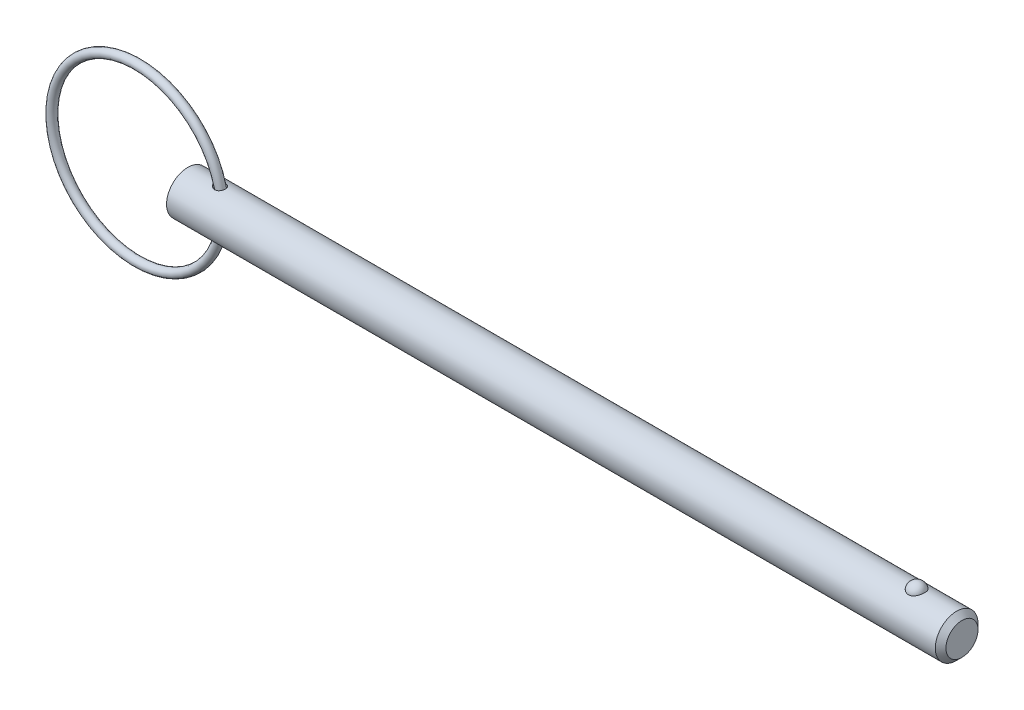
ISO-10303-21;
HEADER;
FILE_DESCRIPTION(('STEP AP214'),'2;1');
FILE_NAME('part.step','',(''),(''),'','','');
FILE_SCHEMA(('AUTOMOTIVE_DESIGN { 1 0 10303 214 1 1 1 1 }'));
ENDSEC;
DATA;
#1=APPLICATION_CONTEXT('core data for automotive mechanical design processes');
#2=APPLICATION_PROTOCOL_DEFINITION('international standard','automotive_design',2000,#1);
#3=PRODUCT_CONTEXT('',#1,'mechanical');
#4=PRODUCT('Part','Part','',(#3));
#5=PRODUCT_RELATED_PRODUCT_CATEGORY('part','',(#4));
#6=PRODUCT_DEFINITION_FORMATION('','',#4);
#7=PRODUCT_DEFINITION_CONTEXT('part definition',#1,'design');
#8=PRODUCT_DEFINITION('design','',#6,#7);
#9=PRODUCT_DEFINITION_SHAPE('','',#8);
#10=(LENGTH_UNIT() NAMED_UNIT(*) SI_UNIT(.MILLI.,.METRE.));
#11=(NAMED_UNIT(*) PLANE_ANGLE_UNIT() SI_UNIT($,.RADIAN.));
#12=(NAMED_UNIT(*) SI_UNIT($,.STERADIAN.) SOLID_ANGLE_UNIT());
#13=UNCERTAINTY_MEASURE_WITH_UNIT(LENGTH_MEASURE(1.E-05),#10,'distance_accuracy_value','');
#14=(GEOMETRIC_REPRESENTATION_CONTEXT(3) GLOBAL_UNCERTAINTY_ASSIGNED_CONTEXT((#13)) GLOBAL_UNIT_ASSIGNED_CONTEXT((#10,
#11,#12)) REPRESENTATION_CONTEXT('',''));
#15=CARTESIAN_POINT('',(0.,0.,0.));
#16=DIRECTION('',(0.,0.,1.));
#17=DIRECTION('',(1.,0.,0.));
#18=AXIS2_PLACEMENT_3D('',#15,#16,#17);
#19=CARTESIAN_POINT('',(-7.52490236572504,0.,0.));
#20=DIRECTION('',(0.,0.,1.));
#21=DIRECTION('',(1.,0.,0.));
#22=AXIS2_PLACEMENT_3D('',#19,#20,#21);
#23=TOROIDAL_SURFACE('',#22,12.7,0.635000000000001);
#24=CARTESIAN_POINT('',(5.81009763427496,0.,0.));
#25=VERTEX_POINT('',#24);
#26=VERTEX_LOOP('',#25);
#27=FACE_BOUND('',#26,.T.);
#28=ADVANCED_FACE('P0_F12',(#27),#23,.T.);
#29=CLOSED_SHELL('',(#28));
#30=MANIFOLD_SOLID_BREP('P0_B1',#29);
#31=CARTESIAN_POINT('',(0.,0.,0.));
#32=DIRECTION('',(1.,0.,0.));
#33=DIRECTION('',(0.,0.,-1.));
#34=AXIS2_PLACEMENT_3D('',#31,#32,#33);
#35=CYLINDRICAL_SURFACE('',#34,3.175);
#36=CARTESIAN_POINT('',(4.01221718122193,3.16142308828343,-0.293307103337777));
#37=CARTESIAN_POINT('',(4.03067993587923,3.15750982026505,-0.335477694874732));
#38=CARTESIAN_POINT('',(4.05297703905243,3.15289835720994,-0.375943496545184));
#39=CARTESIAN_POINT('',(4.10415276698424,3.14284099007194,-0.452407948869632));
#40=CARTESIAN_POINT('',(4.1330447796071,3.13739339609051,-0.488397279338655));
#41=CARTESIAN_POINT('',(4.19615348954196,3.12629932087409,-0.554988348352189));
#42=CARTESIAN_POINT('',(4.23034557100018,3.12065384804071,-0.585613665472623));
#43=CARTESIAN_POINT('',(4.3031328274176,3.10972452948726,-0.641123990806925));
#44=CARTESIAN_POINT('',(4.34172706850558,3.10444060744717,-0.666010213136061));
#45=CARTESIAN_POINT('',(4.42517725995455,3.09444053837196,-0.711079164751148));
#46=CARTESIAN_POINT('',(4.47028158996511,3.08978882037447,-0.730818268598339));
#47=CARTESIAN_POINT('',(4.56327045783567,3.08209858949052,-0.762602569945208));
#48=CARTESIAN_POINT('',(4.61115533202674,3.07906027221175,-0.774646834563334));
#49=CARTESIAN_POINT('',(4.70827322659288,3.0750396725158,-0.790458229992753));
#50=CARTESIAN_POINT('',(4.75750323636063,3.07405312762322,-0.79424252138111));
#51=CARTESIAN_POINT('',(4.85586074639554,3.07433427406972,-0.793155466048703));
#52=CARTESIAN_POINT('',(4.90498828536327,3.07560084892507,-0.788288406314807));
#53=CARTESIAN_POINT('',(4.99830385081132,3.08013122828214,-0.770385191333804));
#54=CARTESIAN_POINT('',(5.04260499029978,3.08325928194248,-0.757902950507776));
#55=CARTESIAN_POINT('',(5.1282462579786,3.09104671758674,-0.725486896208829));
#56=CARTESIAN_POINT('',(5.16958706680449,3.09570574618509,-0.705554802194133));
#57=CARTESIAN_POINT('',(5.24627719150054,3.10576748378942,-0.65981371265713));
#58=CARTESIAN_POINT('',(5.28181038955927,3.11112830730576,-0.634302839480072));
#59=CARTESIAN_POINT('',(5.34802604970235,3.12213947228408,-0.57766778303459));
#60=CARTESIAN_POINT('',(5.37870854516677,3.1277898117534,-0.546543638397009));
#61=CARTESIAN_POINT('',(5.43445707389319,3.13876145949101,-0.479533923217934));
#62=CARTESIAN_POINT('',(5.45951927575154,3.14408254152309,-0.443645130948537));
#63=CARTESIAN_POINT('',(5.50339935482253,3.15381660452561,-0.368122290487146));
#64=CARTESIAN_POINT('',(5.52221691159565,3.15822953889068,-0.328488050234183));
#65=CARTESIAN_POINT('',(5.55335622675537,3.16572312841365,-0.246075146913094));
#66=CARTESIAN_POINT('',(5.56559711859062,3.16878711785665,-0.203264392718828));
#67=CARTESIAN_POINT('',(5.58294807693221,3.17317503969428,-0.116135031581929));
#68=CARTESIAN_POINT('',(5.58805800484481,3.17449893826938,-0.0718163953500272));
#69=CARTESIAN_POINT('',(5.59103306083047,3.17526647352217,0.01723401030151));
#70=CARTESIAN_POINT('',(5.58887304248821,3.17470358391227,0.0619666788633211));
#71=CARTESIAN_POINT('',(5.57730300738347,3.17174350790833,0.15042284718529));
#72=CARTESIAN_POINT('',(5.56789286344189,3.16934628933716,0.1941463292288));
#73=CARTESIAN_POINT('',(5.54204285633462,3.16297605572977,0.27934466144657));
#74=CARTESIAN_POINT('',(5.52560272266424,3.15900298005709,0.320819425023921));
#75=CARTESIAN_POINT('',(5.4860820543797,3.14991364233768,0.400340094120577));
#76=CARTESIAN_POINT('',(5.46300145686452,3.14479736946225,0.438385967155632));
#77=CARTESIAN_POINT('',(5.41080575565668,3.1339965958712,0.509900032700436));
#78=CARTESIAN_POINT('',(5.3817004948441,3.12831302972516,0.54337554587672));
#79=CARTESIAN_POINT('',(5.31818122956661,3.11701107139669,0.604852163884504));
#80=CARTESIAN_POINT('',(5.2837678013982,3.11139267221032,0.632853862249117));
#81=CARTESIAN_POINT('',(5.21096127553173,3.10091904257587,0.682320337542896));
#82=CARTESIAN_POINT('',(5.1726139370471,3.09605639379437,0.703850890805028));
#83=CARTESIAN_POINT('',(5.09274050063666,3.08756769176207,0.740203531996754));
#84=CARTESIAN_POINT('',(5.05121474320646,3.08394150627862,0.755026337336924));
#85=CARTESIAN_POINT('',(4.96650658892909,3.07833156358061,0.777582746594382));
#86=CARTESIAN_POINT('',(4.92333841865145,3.07633606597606,0.785367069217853));
#87=CARTESIAN_POINT('',(4.83627503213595,3.07411756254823,0.794006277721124));
#88=CARTESIAN_POINT('',(4.79237971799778,3.07389479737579,0.794860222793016));
#89=CARTESIAN_POINT('',(4.70375644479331,3.0752087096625,0.789761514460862));
#90=CARTESIAN_POINT('',(4.65904075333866,3.07679607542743,0.783612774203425));
#91=CARTESIAN_POINT('',(4.57116325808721,3.08158486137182,0.764561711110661));
#92=CARTESIAN_POINT('',(4.52800197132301,3.08478681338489,0.751657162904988));
#93=CARTESIAN_POINT('',(4.44149370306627,3.09268658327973,0.718486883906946));
#94=CARTESIAN_POINT('',(4.39831651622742,3.0974680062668,0.697797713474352));
#95=CARTESIAN_POINT('',(4.31591226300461,3.10789270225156,0.649792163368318));
#96=CARTESIAN_POINT('',(4.27668695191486,3.11353635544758,0.622472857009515));
#97=CARTESIAN_POINT('',(4.20182407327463,3.1252888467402,0.560557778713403));
#98=CARTESIAN_POINT('',(4.16638921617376,3.13140725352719,0.525717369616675));
#99=CARTESIAN_POINT('',(4.10227951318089,3.14315144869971,0.450199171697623));
#100=CARTESIAN_POINT('',(4.0736023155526,3.14877740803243,0.409523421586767));
#101=CARTESIAN_POINT('',(4.02575866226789,3.15851130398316,0.325741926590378));
#102=CARTESIAN_POINT('',(4.00615248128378,3.16268619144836,0.282896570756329));
#103=CARTESIAN_POINT('',(3.97532986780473,3.16936826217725,0.1941636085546));
#104=CARTESIAN_POINT('',(3.96410589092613,3.17187694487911,0.148278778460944));
#105=CARTESIAN_POINT('',(3.95155037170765,3.17469339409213,0.0604600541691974));
#106=CARTESIAN_POINT('',(3.9492378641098,3.17521926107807,0.0186712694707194));
#107=CARTESIAN_POINT('',(3.95191506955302,3.1746144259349,-0.0646295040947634));
#108=CARTESIAN_POINT('',(3.9568961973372,3.17348567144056,-0.106141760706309));
#109=CARTESIAN_POINT('',(3.97060099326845,3.17043701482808,-0.172031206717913));
#110=CARTESIAN_POINT('',(3.97717137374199,3.16898333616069,-0.196902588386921));
#111=CARTESIAN_POINT('',(3.99283717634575,3.16556630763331,-0.245794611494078));
#112=CARTESIAN_POINT('',(4.00193224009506,3.16360303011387,-0.269815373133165));
#113=CARTESIAN_POINT('',(4.01221718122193,3.16142308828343,-0.293307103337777));
#114=B_SPLINE_CURVE_WITH_KNOTS('',3,(#36,#37,#38,#39,#40,#41,#42,#43,#44,#45,#46,#47,#48,#49,
#50,#51,#52,#53,#54,#55,#56,#57,#58,#59,#60,#61,#62,#63,#64,#65,#66,#67,#68,#69,#70,#71,#72,#73,
#74,#75,#76,#77,#78,#79,#80,#81,#82,#83,#84,#85,#86,#87,#88,#89,#90,#91,#92,#93,#94,#95,#96,#97,
#98,#99,#100,#101,#102,#103,#104,#105,#106,#107,#108,#109,#110,#111,#112,#113),.UNSPECIFIED.,
.T.,.F.,(4,2,2,2,2,2,2,2,2,2,2,2,2,2,2,2,2,2,2,2,2,2,2,2,2,2,2,2,2,2,2,2,2,2,2,2,2,2,4),(0.,
0.138498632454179,0.277280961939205,0.41543703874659,0.553563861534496,0.701231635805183,
0.848917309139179,0.996295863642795,1.14360140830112,1.28129260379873,1.41895203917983,
1.55053732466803,1.68212170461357,1.81379551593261,1.94547608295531,2.07874074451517,
2.21200799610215,2.34573668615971,2.47946772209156,2.61320390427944,2.74694135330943,
2.8804620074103,3.01396817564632,3.14606745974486,3.27815261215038,3.40927820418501,
3.54042159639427,3.6753294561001,3.81028178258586,3.95399377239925,4.09776931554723,
4.24721954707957,4.39661769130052,4.53771923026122,4.67869361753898,4.80361432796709,
4.92838811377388,5.00555170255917,5.08270434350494),.UNSPECIFIED.);
#115=CARTESIAN_POINT('',(4.01221718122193,3.16142308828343,-0.293307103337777));
#116=VERTEX_POINT('',#115);
#117=EDGE_CURVE('P1_E40',#116,#116,#114,.T.);
#118=ORIENTED_EDGE('',*,*,#117,.T.);
#119=EDGE_LOOP('',(#118));
#120=FACE_BOUND('',#119,.T.);
#121=CARTESIAN_POINT('',(114.31625,0.,0.));
#122=DIRECTION('',(1.,0.,0.));
#123=DIRECTION('',(0.,0.,-1.));
#124=AXIS2_PLACEMENT_3D('',#121,#122,#123);
#125=CIRCLE('',#124,3.175);
#126=CARTESIAN_POINT('',(114.31625,0.,-3.175));
#127=VERTEX_POINT('',#126);
#128=EDGE_CURVE('P1_E25',#127,#127,#125,.T.);
#129=ORIENTED_EDGE('',*,*,#128,.F.);
#130=EDGE_LOOP('',(#129));
#131=FACE_BOUND('',#130,.T.);
#132=CARTESIAN_POINT('',(0.,0.,0.));
#133=DIRECTION('',(1.,0.,0.));
#134=DIRECTION('',(0.,0.,-1.));
#135=AXIS2_PLACEMENT_3D('',#132,#133,#134);
#136=CIRCLE('',#135,3.175);
#137=CARTESIAN_POINT('',(0.,0.,-3.175));
#138=VERTEX_POINT('',#137);
#139=EDGE_CURVE('P1_E9',#138,#138,#136,.T.);
#140=ORIENTED_EDGE('',*,*,#139,.T.);
#141=EDGE_LOOP('',(#140));
#142=FACE_BOUND('',#141,.T.);
#143=CARTESIAN_POINT('',(108.37572762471,2.92898950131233,1.22541646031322));
#144=CARTESIAN_POINT('',(108.312316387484,2.92899434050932,1.2254114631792));
#145=CARTESIAN_POINT('',(108.248797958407,2.93112688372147,1.22034641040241));
#146=CARTESIAN_POINT('',(108.123530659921,2.93942752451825,1.20020949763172));
#147=CARTESIAN_POINT('',(108.061786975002,2.9456063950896,1.18511092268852));
#148=CARTESIAN_POINT('',(107.942065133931,2.96127115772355,1.14540352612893));
#149=CARTESIAN_POINT('',(107.884077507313,2.97074831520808,1.12081980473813));
#150=CARTESIAN_POINT('',(107.773194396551,2.99197584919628,1.06285154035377));
#151=CARTESIAN_POINT('',(107.720296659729,3.00372521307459,1.02947091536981));
#152=CARTESIAN_POINT('',(107.619268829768,3.02865714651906,0.95367409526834));
#153=CARTESIAN_POINT('',(107.571324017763,3.04187163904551,0.911021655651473));
#154=CARTESIAN_POINT('',(107.483036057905,3.06808741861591,0.818400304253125));
#155=CARTESIAN_POINT('',(107.442695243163,3.08108863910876,0.768429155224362));
#156=CARTESIAN_POINT('',(107.368803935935,3.10614903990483,0.660064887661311));
#157=CARTESIAN_POINT('',(107.335633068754,3.11814104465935,0.601396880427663));
#158=CARTESIAN_POINT('',(107.279119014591,3.13926931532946,0.479026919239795));
#159=CARTESIAN_POINT('',(107.255776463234,3.14840539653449,0.415324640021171));
#160=CARTESIAN_POINT('',(107.219178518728,3.16298160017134,0.283885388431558));
#161=CARTESIAN_POINT('',(107.206040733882,3.16837855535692,0.216110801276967));
#162=CARTESIAN_POINT('',(107.190567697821,3.17475386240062,0.0791367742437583));
#163=CARTESIAN_POINT('',(107.188232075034,3.17573236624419,0.00993738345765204));
#164=CARTESIAN_POINT('',(107.194388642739,3.17318075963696,-0.127420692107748));
#165=CARTESIAN_POINT('',(107.202807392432,3.16968122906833,-0.195583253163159));
#166=CARTESIAN_POINT('',(107.230175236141,3.1585790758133,-0.329413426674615));
#167=CARTESIAN_POINT('',(107.249124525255,3.15097637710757,-0.395080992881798));
#168=CARTESIAN_POINT('',(107.297205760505,3.13242485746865,-0.522180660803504));
#169=CARTESIAN_POINT('',(107.326352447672,3.12147119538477,-0.583606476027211));
#170=CARTESIAN_POINT('',(107.394235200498,3.09734973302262,-0.700436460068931));
#171=CARTESIAN_POINT('',(107.432972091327,3.08418174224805,-0.755840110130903));
#172=CARTESIAN_POINT('',(107.519477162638,3.05694884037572,-0.8594045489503));
#173=CARTESIAN_POINT('',(107.567296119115,3.04287919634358,-0.907521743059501));
#174=CARTESIAN_POINT('',(107.670735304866,3.01548927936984,-0.994758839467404));
#175=CARTESIAN_POINT('',(107.726354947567,3.00216895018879,-1.03387941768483));
#176=CARTESIAN_POINT('',(107.842809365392,2.97810316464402,-1.10126594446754));
#177=CARTESIAN_POINT('',(107.903518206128,2.96731170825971,-1.12973256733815));
#178=CARTESIAN_POINT('',(108.029371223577,2.9492893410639,-1.17598467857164));
#179=CARTESIAN_POINT('',(108.094513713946,2.94205708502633,-1.19377420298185));
#180=CARTESIAN_POINT('',(108.223856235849,2.93233065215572,-1.21746387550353));
#181=CARTESIAN_POINT('',(108.287938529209,2.92961621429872,-1.22391763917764));
#182=CARTESIAN_POINT('',(108.416337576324,2.92855752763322,-1.22644976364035));
#183=CARTESIAN_POINT('',(108.480654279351,2.9302123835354,-1.222530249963));
#184=CARTESIAN_POINT('',(108.605523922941,2.9375685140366,-1.2047414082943));
#185=CARTESIAN_POINT('',(108.666131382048,2.94313790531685,-1.19119621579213));
#186=CARTESIAN_POINT('',(108.784110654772,2.95756226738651,-1.15491492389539));
#187=CARTESIAN_POINT('',(108.841482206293,2.9664175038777,-1.13217808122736));
#188=CARTESIAN_POINT('',(108.952769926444,2.98669918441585,-1.07755083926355));
#189=CARTESIAN_POINT('',(109.006584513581,2.99817710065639,-1.04547308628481));
#190=CARTESIAN_POINT('',(109.108147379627,3.0224023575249,-0.973220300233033));
#191=CARTESIAN_POINT('',(109.155894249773,3.03514999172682,-0.933043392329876));
#192=CARTESIAN_POINT('',(109.246581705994,3.06131230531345,-0.843372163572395));
#193=CARTESIAN_POINT('',(109.289158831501,3.07472822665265,-0.793510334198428));
#194=CARTESIAN_POINT('',(109.365676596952,3.10021106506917,-0.687241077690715));
#195=CARTESIAN_POINT('',(109.399615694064,3.1122777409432,-0.630832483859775));
#196=CARTESIAN_POINT('',(109.459120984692,3.134208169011,-0.511059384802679));
#197=CARTESIAN_POINT('',(109.484389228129,3.14399040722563,-0.447531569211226));
#198=CARTESIAN_POINT('',(109.524511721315,3.15983820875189,-0.316827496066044));
#199=CARTESIAN_POINT('',(109.539365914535,3.16590375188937,-0.249651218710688));
#200=CARTESIAN_POINT('',(109.558358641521,3.17370076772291,-0.113549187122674));
#201=CARTESIAN_POINT('',(109.562496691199,3.17543204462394,-0.0446233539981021));
#202=CARTESIAN_POINT('',(109.559969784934,3.17438372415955,0.0929938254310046));
#203=CARTESIAN_POINT('',(109.553305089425,3.17160423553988,0.161685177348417));
#204=CARTESIAN_POINT('',(109.529375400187,3.1618438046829,0.296502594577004));
#205=CARTESIAN_POINT('',(109.512167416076,3.15488546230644,0.36264043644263));
#206=CARTESIAN_POINT('',(109.467547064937,3.13748892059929,0.490896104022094));
#207=CARTESIAN_POINT('',(109.440133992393,3.12705048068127,0.553013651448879));
#208=CARTESIAN_POINT('',(109.375462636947,3.10369139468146,0.671876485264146));
#209=CARTESIAN_POINT('',(109.338146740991,3.0907563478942,0.728587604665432));
#210=CARTESIAN_POINT('',(109.254524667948,3.06381731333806,0.834653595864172));
#211=CARTESIAN_POINT('',(109.208218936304,3.04981337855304,0.884008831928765));
#212=CARTESIAN_POINT('',(109.107718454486,3.02230423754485,0.973916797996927));
#213=CARTESIAN_POINT('',(109.053535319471,3.00879833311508,1.01448227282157));
#214=CARTESIAN_POINT('',(108.938529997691,2.98383625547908,1.08571550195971));
#215=CARTESIAN_POINT('',(108.877705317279,2.9723808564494,1.11637952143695));
#216=CARTESIAN_POINT('',(108.753369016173,2.95329063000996,1.16592590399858));
#217=CARTESIAN_POINT('',(108.690023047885,2.9455373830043,1.18517901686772));
#218=CARTESIAN_POINT('',(108.56076644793,2.93425566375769,1.21284802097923));
#219=CARTESIAN_POINT('',(108.494864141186,2.93071450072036,1.22129647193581));
#220=CARTESIAN_POINT('',(108.411116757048,2.92915255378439,1.22502505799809));
#221=CARTESIAN_POINT('',(108.393426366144,2.92898815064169,1.22541785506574));
#222=CARTESIAN_POINT('',(108.37572762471,2.92898950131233,1.22541646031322));
#223=B_SPLINE_CURVE_WITH_KNOTS('',3,(#143,#144,#145,#146,#147,#148,#149,#150,#151,#152,#153,
#154,#155,#156,#157,#158,#159,#160,#161,#162,#163,#164,#165,#166,#167,#168,#169,#170,#171,#172,
#173,#174,#175,#176,#177,#178,#179,#180,#181,#182,#183,#184,#185,#186,#187,#188,#189,#190,#191,
#192,#193,#194,#195,#196,#197,#198,#199,#200,#201,#202,#203,#204,#205,#206,#207,#208,#209,#210,
#211,#212,#213,#214,#215,#216,#217,#218,#219,#220,#221,#222),.UNSPECIFIED.,.T.,.F.,(4,2,2,2,2,2,
2,2,2,2,2,2,2,2,2,2,2,2,2,2,2,2,2,2,2,2,2,2,2,2,2,2,2,2,2,2,2,2,2,4),(0.,0.19018620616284,
0.380880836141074,0.571074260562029,0.761183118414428,0.956866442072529,1.15260970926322,
1.3570177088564,1.56143892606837,1.76818248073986,1.97491892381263,2.18025109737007,
2.38558707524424,2.59122111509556,2.79687285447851,3.00371012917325,3.21053185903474,
3.41323429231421,3.61586005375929,3.80828192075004,4.0006643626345,4.18685798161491,
4.37306665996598,4.56330302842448,4.7535834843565,4.95345287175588,5.1533579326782,
5.35957003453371,5.56578325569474,5.77200579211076,5.97822335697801,6.18333558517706,
6.38846199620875,6.59480900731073,6.80114579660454,7.00718137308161,7.21329457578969,
7.41228022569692,7.61066481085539,7.66374777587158),.UNSPECIFIED.);
#224=CARTESIAN_POINT('',(108.37572762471,2.92898950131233,1.22541646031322));
#225=VERTEX_POINT('',#224);
#226=EDGE_CURVE('P1_E34',#225,#225,#223,.T.);
#227=ORIENTED_EDGE('',*,*,#226,.T.);
#228=EDGE_LOOP('',(#227));
#229=FACE_BOUND('',#228,.T.);
#230=CARTESIAN_POINT('',(4.01221718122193,-3.16142308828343,-0.293307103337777));
#231=CARTESIAN_POINT('',(3.99616924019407,-3.16482429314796,-0.256648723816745));
#232=CARTESIAN_POINT('',(3.9830087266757,-3.16769953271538,-0.218679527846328));
#233=CARTESIAN_POINT('',(3.96305928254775,-3.17210414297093,-0.141027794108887));
#234=CARTESIAN_POINT('',(3.95626715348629,-3.17363418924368,-0.101346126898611));
#235=CARTESIAN_POINT('',(3.94940055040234,-3.17518116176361,-0.0213063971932));
#236=CARTESIAN_POINT('',(3.94933713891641,-3.17519559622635,0.0190526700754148));
#237=CARTESIAN_POINT('',(3.95595884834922,-3.173703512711,0.0991848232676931));
#238=CARTESIAN_POINT('',(3.96264478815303,-3.17219681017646,0.138957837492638));
#239=CARTESIAN_POINT('',(3.98225001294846,-3.16786598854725,0.216153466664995));
#240=CARTESIAN_POINT('',(3.99506606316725,-3.16506371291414,0.253603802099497));
#241=CARTESIAN_POINT('',(4.0263107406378,-3.15843101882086,0.325977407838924));
#242=CARTESIAN_POINT('',(4.04474073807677,-3.15460034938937,0.360900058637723));
#243=CARTESIAN_POINT('',(4.0879644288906,-3.14597426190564,0.429836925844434));
#244=CARTESIAN_POINT('',(4.1131071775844,-3.1411307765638,0.463625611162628));
#245=CARTESIAN_POINT('',(4.16818460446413,-3.13112506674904,0.526983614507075));
#246=CARTESIAN_POINT('',(4.1981214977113,-3.1259626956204,0.556550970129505));
#247=CARTESIAN_POINT('',(4.26550089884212,-3.11521604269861,0.614003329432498));
#248=CARTESIAN_POINT('',(4.3034063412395,-3.10964747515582,0.641349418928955));
#249=CARTESIAN_POINT('',(4.38313680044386,-3.09926692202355,0.68977116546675));
#250=CARTESIAN_POINT('',(4.42496355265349,-3.09445527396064,0.710844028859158));
#251=CARTESIAN_POINT('',(4.51417855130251,-3.08586578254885,0.747282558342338));
#252=CARTESIAN_POINT('',(4.56175044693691,-3.08216903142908,0.762221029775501));
#253=CARTESIAN_POINT('',(4.6588493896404,-3.076742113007,0.783842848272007));
#254=CARTESIAN_POINT('',(4.70837600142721,-3.07501151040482,0.790528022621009));
#255=CARTESIAN_POINT('',(4.80630979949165,-3.07383938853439,0.7950736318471));
#256=CARTESIAN_POINT('',(4.85470314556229,-3.07432752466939,0.793205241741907));
#257=CARTESIAN_POINT('',(4.95034305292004,-3.07744489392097,0.781023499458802));
#258=CARTESIAN_POINT('',(4.99759012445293,-3.0800731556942,0.770713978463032));
#259=CARTESIAN_POINT('',(5.08626194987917,-3.08693276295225,0.742738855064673));
#260=CARTESIAN_POINT('',(5.1278649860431,-3.09104603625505,0.725607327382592));
#261=CARTESIAN_POINT('',(5.20739903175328,-3.10040746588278,0.684500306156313));
#262=CARTESIAN_POINT('',(5.24533051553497,-3.10565547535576,0.660525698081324));
#263=CARTESIAN_POINT('',(5.31542898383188,-3.11652031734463,0.607160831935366));
#264=CARTESIAN_POINT('',(5.34772618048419,-3.12212297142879,0.577938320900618));
#265=CARTESIAN_POINT('',(5.40696901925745,-3.13320503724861,0.51447712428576));
#266=CARTESIAN_POINT('',(5.43391452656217,-3.13868444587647,0.48023831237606));
#267=CARTESIAN_POINT('',(5.4820017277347,-3.14897211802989,0.407384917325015));
#268=CARTESIAN_POINT('',(5.50309185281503,-3.15377424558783,0.368735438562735));
#269=CARTESIAN_POINT('',(5.53866240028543,-3.16213411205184,0.288380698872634));
#270=CARTESIAN_POINT('',(5.55314252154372,-3.16569179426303,0.246675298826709));
#271=CARTESIAN_POINT('',(5.57526489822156,-3.17121134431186,0.160950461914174));
#272=CARTESIAN_POINT('',(5.58283917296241,-3.17315732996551,0.116912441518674));
#273=CARTESIAN_POINT('',(5.59072863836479,-3.17518554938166,0.0281485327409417));
#274=CARTESIAN_POINT('',(5.59104374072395,-3.17526776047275,-0.016577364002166));
#275=CARTESIAN_POINT('',(5.58440302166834,-3.17355847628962,-0.105510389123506));
#276=CARTESIAN_POINT('',(5.57743745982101,-3.17176447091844,-0.149716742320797));
#277=CARTESIAN_POINT('',(5.55638330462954,-3.16649194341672,-0.23629572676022));
#278=CARTESIAN_POINT('',(5.54229454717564,-3.16301338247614,-0.278668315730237));
#279=CARTESIAN_POINT('',(5.50732506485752,-3.15474878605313,-0.360378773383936));
#280=CARTESIAN_POINT('',(5.48644386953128,-3.14996266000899,-0.399716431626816));
#281=CARTESIAN_POINT('',(5.43839310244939,-3.13960947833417,-0.47422997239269));
#282=CARTESIAN_POINT('',(5.41122365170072,-3.1340424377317,-0.509405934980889));
#283=CARTESIAN_POINT('',(5.35140258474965,-3.12277449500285,-0.574449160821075));
#284=CARTESIAN_POINT('',(5.31877354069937,-3.11707422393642,-0.604337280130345));
#285=CARTESIAN_POINT('',(5.24883067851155,-3.10616541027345,-0.658116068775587));
#286=CARTESIAN_POINT('',(5.21151752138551,-3.1009567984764,-0.682007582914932));
#287=CARTESIAN_POINT('',(5.13375489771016,-3.09168295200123,-0.722881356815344));
#288=CARTESIAN_POINT('',(5.09335030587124,-3.0876042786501,-0.739946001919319));
#289=CARTESIAN_POINT('',(5.0101742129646,-3.08094605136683,-0.767199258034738));
#290=CARTESIAN_POINT('',(4.96740279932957,-3.07836644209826,-0.777388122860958));
#291=CARTESIAN_POINT('',(4.88066362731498,-3.07495302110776,-0.790782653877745));
#292=CARTESIAN_POINT('',(4.8366943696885,-3.07412150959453,-0.793979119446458));
#293=CARTESIAN_POINT('',(4.74880185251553,-3.07424620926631,-0.793495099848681));
#294=CARTESIAN_POINT('',(4.70487860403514,-3.07520278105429,-0.789813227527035));
#295=CARTESIAN_POINT('',(4.61626456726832,-3.07882608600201,-0.775571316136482));
#296=CARTESIAN_POINT('',(4.571624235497,-3.08156578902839,-0.764717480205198));
#297=CARTESIAN_POINT('',(4.48464592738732,-3.08847909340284,-0.736297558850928));
#298=CARTESIAN_POINT('',(4.44230893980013,-3.09265330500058,-0.718728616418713));
#299=CARTESIAN_POINT('',(4.35823256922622,-3.10228551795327,-0.675988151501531));
#300=CARTESIAN_POINT('',(4.31671586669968,-3.10780992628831,-0.650392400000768));
#301=CARTESIAN_POINT('',(4.23853942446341,-3.11932897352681,-0.592684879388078));
#302=CARTESIAN_POINT('',(4.20188053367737,-3.12532369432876,-0.560571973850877));
#303=CARTESIAN_POINT('',(4.13583653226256,-3.13687565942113,-0.491740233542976));
#304=CARTESIAN_POINT('',(4.10623659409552,-3.14244088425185,-0.455229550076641));
#305=CARTESIAN_POINT('',(4.05384351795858,-3.1527191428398,-0.377513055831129));
#306=CARTESIAN_POINT('',(4.03104346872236,-3.1574330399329,-0.336312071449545));
#307=CARTESIAN_POINT('',(4.01221718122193,-3.16142308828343,-0.293307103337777));
#308=B_SPLINE_CURVE_WITH_KNOTS('',3,(#230,#231,#232,#233,#234,#235,#236,#237,#238,#239,#240,
#241,#242,#243,#244,#245,#246,#247,#248,#249,#250,#251,#252,#253,#254,#255,#256,#257,#258,#259,
#260,#261,#262,#263,#264,#265,#266,#267,#268,#269,#270,#271,#272,#273,#274,#275,#276,#277,#278,
#279,#280,#281,#282,#283,#284,#285,#286,#287,#288,#289,#290,#291,#292,#293,#294,#295,#296,#297,
#298,#299,#300,#301,#302,#303,#304,#305,#306,#307),.UNSPECIFIED.,.T.,.F.,(4,2,2,2,2,2,2,2,2,2,2,
2,2,2,2,2,2,2,2,2,2,2,2,2,2,2,2,2,2,2,2,2,2,2,2,2,2,2,4),(0.,0.120338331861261,
0.240616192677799,0.361091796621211,0.481582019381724,0.600110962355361,0.718668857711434,
0.845336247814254,0.972062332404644,1.1126676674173,1.25333552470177,1.40259505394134,
1.55182153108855,1.69635040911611,1.84081372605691,1.97568175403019,2.11053233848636,
2.24166080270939,2.37279256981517,2.50504501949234,2.63730349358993,2.77085027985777,
2.90439869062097,3.03812599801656,3.17185638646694,3.30559603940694,3.43933311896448,
3.57253035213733,3.70570880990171,3.83722775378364,3.96874184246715,4.10042887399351,
4.23214246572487,4.36961700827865,4.5071501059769,4.65373408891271,4.8003436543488,
4.94166003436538,5.08283228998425),.UNSPECIFIED.);
#309=CARTESIAN_POINT('',(4.01221718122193,-3.16142308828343,-0.293307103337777));
#310=VERTEX_POINT('',#309);
#311=EDGE_CURVE('P1_E17',#310,#310,#308,.T.);
#312=ORIENTED_EDGE('',*,*,#311,.T.);
#313=EDGE_LOOP('',(#312));
#314=FACE_BOUND('',#313,.T.);
#315=ADVANCED_FACE('P1_F13',(#120,#131,#142,#229,#314),#35,.T.);
#316=CARTESIAN_POINT('',(0.,0.,0.));
#317=DIRECTION('',(-1.,0.,0.));
#318=DIRECTION('',(0.,0.,1.));
#319=AXIS2_PLACEMENT_3D('',#316,#317,#318);
#320=PLANE('',#319);
#321=ORIENTED_EDGE('',*,*,#139,.F.);
#322=EDGE_LOOP('',(#321));
#323=FACE_BOUND('',#322,.T.);
#324=ADVANCED_FACE('P1_F15',(#323),#320,.T.);
#325=CARTESIAN_POINT('',(115.11,0.,0.));
#326=DIRECTION('',(-1.,0.,0.));
#327=DIRECTION('',(0.,0.,1.));
#328=AXIS2_PLACEMENT_3D('',#325,#326,#327);
#329=CONICAL_SURFACE('',#328,2.38125000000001,0.785398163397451);
#330=ORIENTED_EDGE('',*,*,#128,.T.);
#331=EDGE_LOOP('',(#330));
#332=FACE_BOUND('',#331,.T.);
#333=CARTESIAN_POINT('',(115.11,0.,0.));
#334=DIRECTION('',(1.,0.,0.));
#335=DIRECTION('',(0.,0.,-1.));
#336=AXIS2_PLACEMENT_3D('',#333,#334,#335);
#337=CIRCLE('',#336,2.38125000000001);
#338=CARTESIAN_POINT('',(115.11,0.,-2.38125000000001));
#339=VERTEX_POINT('',#338);
#340=EDGE_CURVE('P1_E30',#339,#339,#337,.T.);
#341=ORIENTED_EDGE('',*,*,#340,.F.);
#342=EDGE_LOOP('',(#341));
#343=FACE_BOUND('',#342,.T.);
#344=ADVANCED_FACE('P1_F55',(#332,#343),#329,.T.);
#345=CARTESIAN_POINT('',(115.11,2.38125000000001,0.));
#346=DIRECTION('',(1.,0.,0.));
#347=DIRECTION('',(0.,0.,-1.));
#348=AXIS2_PLACEMENT_3D('',#345,#346,#347);
#349=PLANE('',#348);
#350=ORIENTED_EDGE('',*,*,#340,.T.);
#351=EDGE_LOOP('',(#350));
#352=FACE_BOUND('',#351,.T.);
#353=ADVANCED_FACE('P1_F51',(#352),#349,.T.);
#354=CARTESIAN_POINT('',(108.37572762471,2.8575,0.));
#355=DIRECTION('',(-1.,0.,0.));
#356=DIRECTION('',(0.,1.,0.));
#357=AXIS2_PLACEMENT_3D('',#354,#355,#356);
#358=SPHERICAL_SURFACE('',#357,1.22750000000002);
#359=ORIENTED_EDGE('',*,*,#226,.F.);
#360=EDGE_LOOP('',(#359));
#361=FACE_BOUND('',#360,.T.);
#362=ADVANCED_FACE('P1_F46',(#361),#358,.T.);
#363=CARTESIAN_POINT('',(-7.52490236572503,0.,0.));
#364=DIRECTION('',(0.,0.,1.));
#365=DIRECTION('',(1.,0.,0.));
#366=AXIS2_PLACEMENT_3D('',#363,#364,#365);
#367=TOROIDAL_SURFACE('',#366,12.7,0.79375);
#368=ORIENTED_EDGE('',*,*,#311,.F.);
#369=EDGE_LOOP('',(#368));
#370=FACE_BOUND('',#369,.T.);
#371=ORIENTED_EDGE('',*,*,#117,.F.);
#372=EDGE_LOOP('',(#371));
#373=FACE_BOUND('',#372,.T.);
#374=ADVANCED_FACE('P1_F50',(#370,#373),#367,.F.);
#375=CLOSED_SHELL('',(#315,#324,#344,#353,#362,#374));
#376=MANIFOLD_SOLID_BREP('P1_B1',#375);
#377=ADVANCED_BREP_SHAPE_REPRESENTATION('',(#18,#30,#376),#14);
#378=SHAPE_DEFINITION_REPRESENTATION(#9,#377);
ENDSEC;
END-ISO-10303-21;
